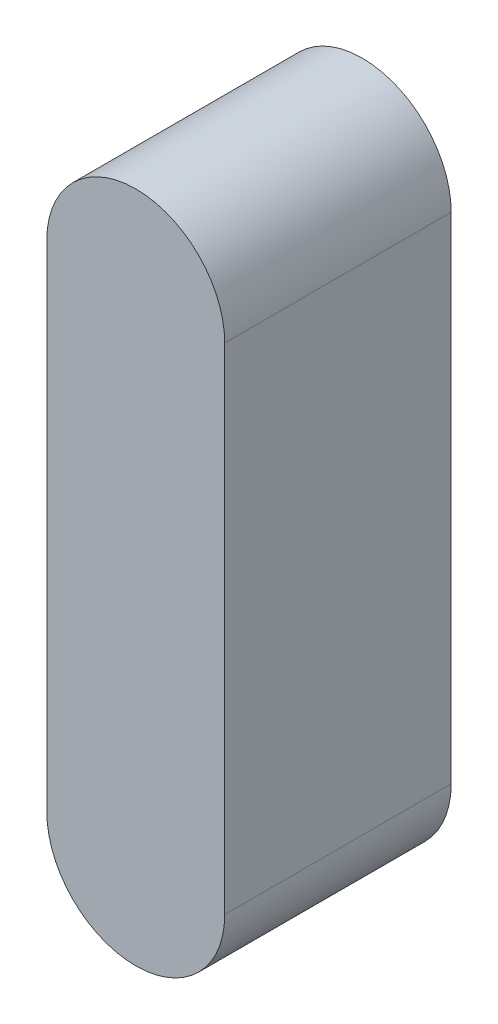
ISO-10303-21;
HEADER;
FILE_DESCRIPTION(('STEP AP214'),'2;1');
FILE_NAME('part.step','',(''),(''),'','','');
FILE_SCHEMA(('AUTOMOTIVE_DESIGN { 1 0 10303 214 1 1 1 1 }'));
ENDSEC;
DATA;
#1=APPLICATION_CONTEXT('core data for automotive mechanical design processes');
#2=APPLICATION_PROTOCOL_DEFINITION('international standard','automotive_design',2000,#1);
#3=PRODUCT_CONTEXT('',#1,'mechanical');
#4=PRODUCT('Part','Part','',(#3));
#5=PRODUCT_RELATED_PRODUCT_CATEGORY('part','',(#4));
#6=PRODUCT_DEFINITION_FORMATION('','',#4);
#7=PRODUCT_DEFINITION_CONTEXT('part definition',#1,'design');
#8=PRODUCT_DEFINITION('design','',#6,#7);
#9=PRODUCT_DEFINITION_SHAPE('','',#8);
#10=(LENGTH_UNIT() NAMED_UNIT(*) SI_UNIT(.MILLI.,.METRE.));
#11=(NAMED_UNIT(*) PLANE_ANGLE_UNIT() SI_UNIT($,.RADIAN.));
#12=(NAMED_UNIT(*) SI_UNIT($,.STERADIAN.) SOLID_ANGLE_UNIT());
#13=UNCERTAINTY_MEASURE_WITH_UNIT(LENGTH_MEASURE(1.E-05),#10,'distance_accuracy_value','');
#14=(GEOMETRIC_REPRESENTATION_CONTEXT(3) GLOBAL_UNCERTAINTY_ASSIGNED_CONTEXT((#13)) GLOBAL_UNIT_ASSIGNED_CONTEXT((#10,
#11,#12)) REPRESENTATION_CONTEXT('',''));
#15=CARTESIAN_POINT('',(0.,0.,0.));
#16=DIRECTION('',(0.,0.,1.));
#17=DIRECTION('',(1.,0.,0.));
#18=AXIS2_PLACEMENT_3D('',#15,#16,#17);
#19=CARTESIAN_POINT('',(0.,9.7155,8.89));
#20=DIRECTION('',(0.,0.,-1.));
#21=DIRECTION('',(-1.,0.,0.));
#22=AXIS2_PLACEMENT_3D('',#19,#20,#21);
#23=CYLINDRICAL_SURFACE('',#22,3.4925);
#24=CARTESIAN_POINT('',(0.,9.7155,0.));
#25=DIRECTION('',(0.,0.,1.));
#26=DIRECTION('',(1.,0.,0.));
#27=AXIS2_PLACEMENT_3D('',#24,#25,#26);
#28=CIRCLE('',#27,3.4925);
#29=CARTESIAN_POINT('',(3.4925,9.7155,0.));
#30=VERTEX_POINT('',#29);
#31=CARTESIAN_POINT('',(-3.4925,9.7155,0.));
#32=VERTEX_POINT('',#31);
#33=EDGE_CURVE('E97',#30,#32,#28,.T.);
#34=ORIENTED_EDGE('',*,*,#33,.T.);
#35=DIRECTION('',(0.,0.,-1.));
#36=VECTOR('',#35,1.);
#37=CARTESIAN_POINT('',(-3.4925,9.7155,8.89));
#38=LINE('',#37,#36);
#39=CARTESIAN_POINT('',(-3.4925,9.7155,8.89));
#40=VERTEX_POINT('',#39);
#41=EDGE_CURVE('E11',#40,#32,#38,.T.);
#42=ORIENTED_EDGE('',*,*,#41,.F.);
#43=CARTESIAN_POINT('',(0.,9.7155,8.89));
#44=DIRECTION('',(0.,0.,1.));
#45=DIRECTION('',(1.,0.,0.));
#46=AXIS2_PLACEMENT_3D('',#43,#44,#45);
#47=CIRCLE('',#46,3.4925);
#48=CARTESIAN_POINT('',(3.4925,9.7155,8.89));
#49=VERTEX_POINT('',#48);
#50=EDGE_CURVE('E85',#49,#40,#47,.T.);
#51=ORIENTED_EDGE('',*,*,#50,.F.);
#52=DIRECTION('',(0.,0.,-1.));
#53=VECTOR('',#52,1.);
#54=CARTESIAN_POINT('',(3.4925,9.7155,8.89));
#55=LINE('',#54,#53);
#56=EDGE_CURVE('E93',#49,#30,#55,.T.);
#57=ORIENTED_EDGE('',*,*,#56,.T.);
#58=EDGE_LOOP('',(#34,#42,#51,#57));
#59=FACE_BOUND('',#58,.T.);
#60=ADVANCED_FACE('F34',(#59),#23,.T.);
#61=CARTESIAN_POINT('',(-3.4925,9.7155,8.89));
#62=DIRECTION('',(1.,0.,0.));
#63=DIRECTION('',(0.,0.,-1.));
#64=AXIS2_PLACEMENT_3D('',#61,#62,#63);
#65=PLANE('',#64);
#66=DIRECTION('',(0.,-1.,0.));
#67=VECTOR('',#66,1.);
#68=CARTESIAN_POINT('',(-3.4925,9.7155,0.));
#69=LINE('',#68,#67);
#70=CARTESIAN_POINT('',(-3.4925,-9.7155,0.));
#71=VERTEX_POINT('',#70);
#72=EDGE_CURVE('E89',#32,#71,#69,.T.);
#73=ORIENTED_EDGE('',*,*,#72,.T.);
#74=DIRECTION('',(0.,0.,-1.));
#75=VECTOR('',#74,1.);
#76=CARTESIAN_POINT('',(-3.4925,-9.7155,8.89));
#77=LINE('',#76,#75);
#78=CARTESIAN_POINT('',(-3.4925,-9.7155,8.89));
#79=VERTEX_POINT('',#78);
#80=EDGE_CURVE('E42',#79,#71,#77,.T.);
#81=ORIENTED_EDGE('',*,*,#80,.F.);
#82=DIRECTION('',(0.,-1.,0.));
#83=VECTOR('',#82,1.);
#84=CARTESIAN_POINT('',(-3.4925,9.7155,8.89));
#85=LINE('',#84,#83);
#86=EDGE_CURVE('E80',#40,#79,#85,.T.);
#87=ORIENTED_EDGE('',*,*,#86,.F.);
#88=ORIENTED_EDGE('',*,*,#41,.T.);
#89=EDGE_LOOP('',(#73,#81,#87,#88));
#90=FACE_BOUND('',#89,.T.);
#91=ADVANCED_FACE('F88',(#90),#65,.F.);
#92=CARTESIAN_POINT('',(0.,-9.7155,8.89));
#93=DIRECTION('',(0.,0.,-1.));
#94=DIRECTION('',(-1.,0.,0.));
#95=AXIS2_PLACEMENT_3D('',#92,#93,#94);
#96=CYLINDRICAL_SURFACE('',#95,3.4925);
#97=CARTESIAN_POINT('',(0.,-9.7155,0.));
#98=DIRECTION('',(0.,0.,1.));
#99=DIRECTION('',(1.,0.,0.));
#100=AXIS2_PLACEMENT_3D('',#97,#98,#99);
#101=CIRCLE('',#100,3.4925);
#102=CARTESIAN_POINT('',(3.4925,-9.7155,0.));
#103=VERTEX_POINT('',#102);
#104=EDGE_CURVE('E67',#71,#103,#101,.T.);
#105=ORIENTED_EDGE('',*,*,#104,.T.);
#106=DIRECTION('',(0.,0.,-1.));
#107=VECTOR('',#106,1.);
#108=CARTESIAN_POINT('',(3.4925,-9.7155,8.89));
#109=LINE('',#108,#107);
#110=CARTESIAN_POINT('',(3.4925,-9.7155,8.89));
#111=VERTEX_POINT('',#110);
#112=EDGE_CURVE('E90',#111,#103,#109,.T.);
#113=ORIENTED_EDGE('',*,*,#112,.F.);
#114=CARTESIAN_POINT('',(0.,-9.7155,8.89));
#115=DIRECTION('',(0.,0.,1.));
#116=DIRECTION('',(1.,0.,0.));
#117=AXIS2_PLACEMENT_3D('',#114,#115,#116);
#118=CIRCLE('',#117,3.4925);
#119=EDGE_CURVE('E83',#79,#111,#118,.T.);
#120=ORIENTED_EDGE('',*,*,#119,.F.);
#121=ORIENTED_EDGE('',*,*,#80,.T.);
#122=EDGE_LOOP('',(#105,#113,#120,#121));
#123=FACE_BOUND('',#122,.T.);
#124=ADVANCED_FACE('F91',(#123),#96,.T.);
#125=CARTESIAN_POINT('',(3.4925,9.7155,8.89));
#126=DIRECTION('',(-1.,0.,0.));
#127=DIRECTION('',(0.,0.,1.));
#128=AXIS2_PLACEMENT_3D('',#125,#126,#127);
#129=PLANE('',#128);
#130=DIRECTION('',(0.,1.,0.));
#131=VECTOR('',#130,1.);
#132=CARTESIAN_POINT('',(3.4925,9.7155,0.));
#133=LINE('',#132,#131);
#134=EDGE_CURVE('E73',#103,#30,#133,.T.);
#135=ORIENTED_EDGE('',*,*,#134,.T.);
#136=ORIENTED_EDGE('',*,*,#56,.F.);
#137=DIRECTION('',(0.,1.,0.));
#138=VECTOR('',#137,1.);
#139=CARTESIAN_POINT('',(3.4925,9.7155,8.89));
#140=LINE('',#139,#138);
#141=EDGE_CURVE('E50',#111,#49,#140,.T.);
#142=ORIENTED_EDGE('',*,*,#141,.F.);
#143=ORIENTED_EDGE('',*,*,#112,.T.);
#144=EDGE_LOOP('',(#135,#136,#142,#143));
#145=FACE_BOUND('',#144,.T.);
#146=ADVANCED_FACE('F104',(#145),#129,.F.);
#147=CARTESIAN_POINT('',(0.,9.7155,8.89));
#148=DIRECTION('',(0.,0.,1.));
#149=DIRECTION('',(1.,0.,0.));
#150=AXIS2_PLACEMENT_3D('',#147,#148,#149);
#151=PLANE('',#150);
#152=ORIENTED_EDGE('',*,*,#50,.T.);
#153=ORIENTED_EDGE('',*,*,#86,.T.);
#154=ORIENTED_EDGE('',*,*,#119,.T.);
#155=ORIENTED_EDGE('',*,*,#141,.T.);
#156=EDGE_LOOP('',(#152,#153,#154,#155));
#157=FACE_BOUND('',#156,.T.);
#158=ADVANCED_FACE('F81',(#157),#151,.T.);
#159=CARTESIAN_POINT('',(0.,9.7155,0.));
#160=DIRECTION('',(0.,0.,1.));
#161=DIRECTION('',(1.,0.,0.));
#162=AXIS2_PLACEMENT_3D('',#159,#160,#161);
#163=PLANE('',#162);
#164=ORIENTED_EDGE('',*,*,#33,.F.);
#165=ORIENTED_EDGE('',*,*,#134,.F.);
#166=ORIENTED_EDGE('',*,*,#104,.F.);
#167=ORIENTED_EDGE('',*,*,#72,.F.);
#168=EDGE_LOOP('',(#164,#165,#166,#167));
#169=FACE_BOUND('',#168,.T.);
#170=ADVANCED_FACE('F107',(#169),#163,.F.);
#171=CLOSED_SHELL('',(#60,#91,#124,#146,#158,#170));
#172=MANIFOLD_SOLID_BREP('B2',#171);
#173=ADVANCED_BREP_SHAPE_REPRESENTATION('',(#18,#172),#14);
#174=SHAPE_DEFINITION_REPRESENTATION(#9,#173);
ENDSEC;
END-ISO-10303-21;
